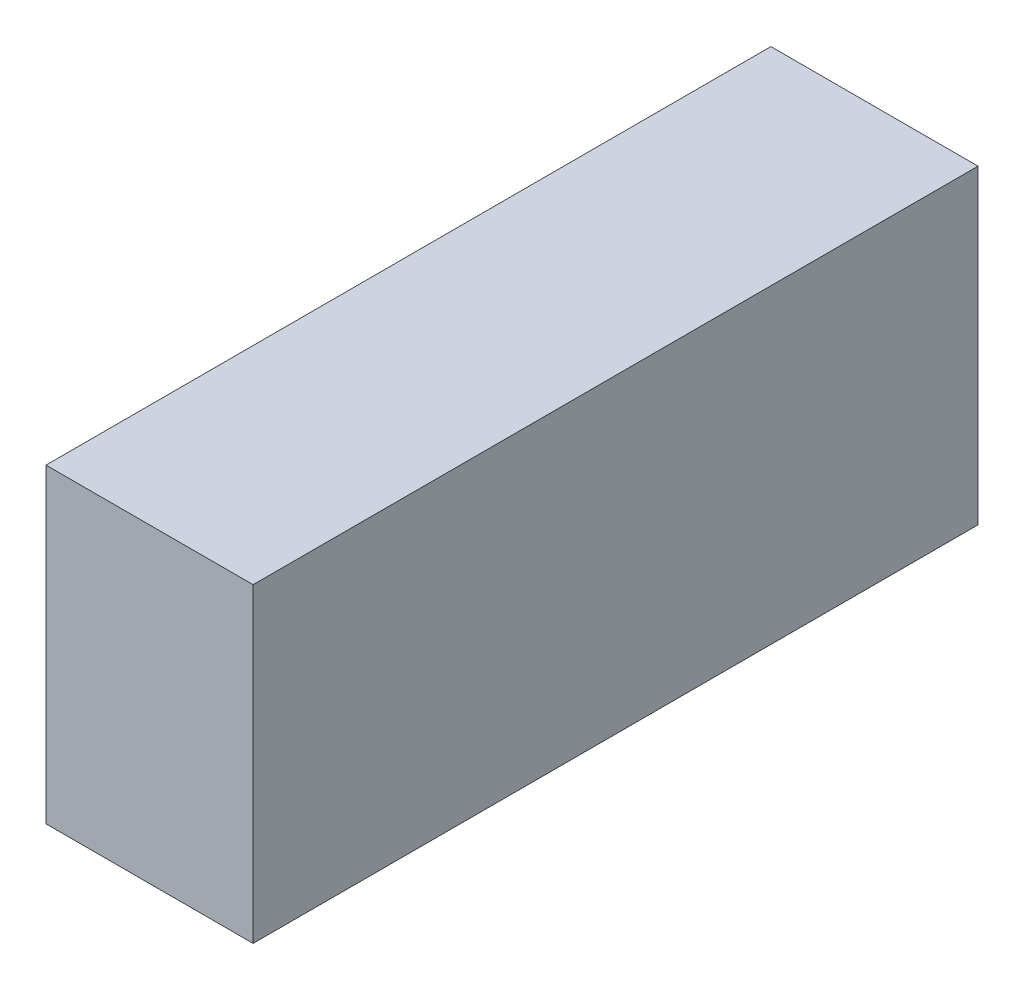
from build123d import *

# Parameters (mm, degrees)
SKIZZE1_W                       = 20
SKIZZE1_H                       = 30
AUFSATZ_LINEAR_AUSTRAGEN1_DEPTH = 70


with BuildPart() as part:
    # Skizze1 → Aufsatz-Linear austragen1 (new body)
    with BuildSketch(Plane.XY):
        with Locations((0, 15)):
            Rectangle(SKIZZE1_W, SKIZZE1_H)
    extrude(amount=AUFSATZ_LINEAR_AUSTRAGEN1_DEPTH)


solid = part.part
